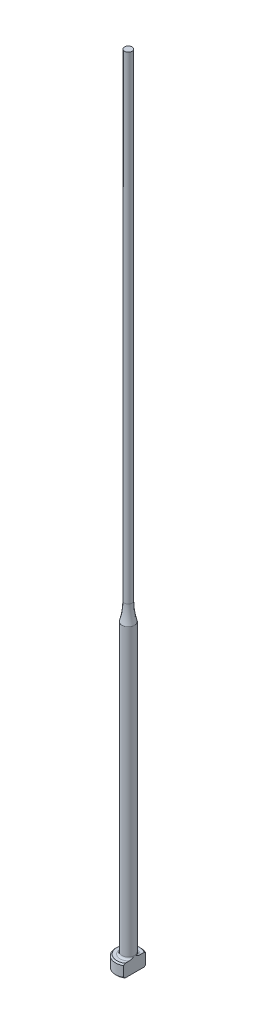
ISO-10303-21;
HEADER;
FILE_DESCRIPTION(('STEP AP214'),'2;1');
FILE_NAME('part.step','',(''),(''),'','','');
FILE_SCHEMA(('AUTOMOTIVE_DESIGN { 1 0 10303 214 1 1 1 1 }'));
ENDSEC;
DATA;
#1=APPLICATION_CONTEXT('core data for automotive mechanical design processes');
#2=APPLICATION_PROTOCOL_DEFINITION('international standard','automotive_design',2000,#1);
#3=PRODUCT_CONTEXT('',#1,'mechanical');
#4=PRODUCT('Part','Part','',(#3));
#5=PRODUCT_RELATED_PRODUCT_CATEGORY('part','',(#4));
#6=PRODUCT_DEFINITION_FORMATION('','',#4);
#7=PRODUCT_DEFINITION_CONTEXT('part definition',#1,'design');
#8=PRODUCT_DEFINITION('design','',#6,#7);
#9=PRODUCT_DEFINITION_SHAPE('','',#8);
#10=(LENGTH_UNIT() NAMED_UNIT(*) SI_UNIT(.MILLI.,.METRE.));
#11=(NAMED_UNIT(*) PLANE_ANGLE_UNIT() SI_UNIT($,.RADIAN.));
#12=(NAMED_UNIT(*) SI_UNIT($,.STERADIAN.) SOLID_ANGLE_UNIT());
#13=UNCERTAINTY_MEASURE_WITH_UNIT(LENGTH_MEASURE(1.E-05),#10,'distance_accuracy_value','');
#14=(GEOMETRIC_REPRESENTATION_CONTEXT(3) GLOBAL_UNCERTAINTY_ASSIGNED_CONTEXT((#13)) GLOBAL_UNIT_ASSIGNED_CONTEXT((#10,
#11,#12)) REPRESENTATION_CONTEXT('',''));
#15=CARTESIAN_POINT('',(0.,0.,0.));
#16=DIRECTION('',(0.,0.,1.));
#17=DIRECTION('',(1.,0.,0.));
#18=AXIS2_PLACEMENT_3D('',#15,#16,#17);
#19=CARTESIAN_POINT('',(-1.99999999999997,2.,0.));
#20=DIRECTION('',(0.,1.,0.));
#21=DIRECTION('',(0.,0.,1.));
#22=AXIS2_PLACEMENT_3D('',#19,#20,#21);
#23=PLANE('',#22);
#24=CARTESIAN_POINT('',(0.,2.,0.));
#25=DIRECTION('',(0.,1.,0.));
#26=DIRECTION('',(0.,0.,1.));
#27=AXIS2_PLACEMENT_3D('',#24,#25,#26);
#28=CIRCLE('',#27,1.79999999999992);
#29=CARTESIAN_POINT('',(0.999999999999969,2.,-1.4966629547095));
#30=VERTEX_POINT('',#29);
#31=CARTESIAN_POINT('',(0.999999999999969,2.,1.4966629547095));
#32=VERTEX_POINT('',#31);
#33=EDGE_CURVE('E187',#30,#32,#28,.T.);
#34=ORIENTED_EDGE('',*,*,#33,.T.);
#35=DIRECTION('',(0.,0.,-1.));
#36=VECTOR('',#35,1.);
#37=CARTESIAN_POINT('',(0.999999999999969,2.,0.));
#38=LINE('',#37,#36);
#39=CARTESIAN_POINT('',(0.999999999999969,2.00000000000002,0.830662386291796));
#40=VERTEX_POINT('',#39);
#41=EDGE_CURVE('E57',#32,#40,#38,.T.);
#42=ORIENTED_EDGE('',*,*,#41,.T.);
#43=CARTESIAN_POINT('',(0.,2.,0.));
#44=DIRECTION('',(0.,1.,0.));
#45=DIRECTION('',(0.,0.,1.));
#46=AXIS2_PLACEMENT_3D('',#43,#44,#45);
#47=CIRCLE('',#46,1.29999999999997);
#48=CARTESIAN_POINT('',(0.999999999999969,2.00000000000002,-0.830662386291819));
#49=VERTEX_POINT('',#48);
#50=EDGE_CURVE('E108',#40,#49,#47,.F.);
#51=ORIENTED_EDGE('',*,*,#50,.T.);
#52=EDGE_CURVE('E137',#49,#30,#38,.T.);
#53=ORIENTED_EDGE('',*,*,#52,.T.);
#54=EDGE_LOOP('',(#34,#42,#51,#53));
#55=FACE_BOUND('',#54,.T.);
#56=ADVANCED_FACE('F32',(#55),#23,.T.);
#57=CARTESIAN_POINT('',(0.,259.958771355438,0.));
#58=DIRECTION('',(0.,1.,0.));
#59=DIRECTION('',(0.,0.,1.));
#60=AXIS2_PLACEMENT_3D('',#57,#58,#59);
#61=CYLINDRICAL_SURFACE('',#60,1.99999999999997);
#62=CARTESIAN_POINT('',(0.,1.79999999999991,0.));
#63=DIRECTION('',(0.,1.,0.));
#64=DIRECTION('',(0.,0.,1.));
#65=AXIS2_PLACEMENT_3D('',#62,#63,#64);
#66=CIRCLE('',#65,1.99999999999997);
#67=CARTESIAN_POINT('',(0.999999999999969,1.79999999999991,1.73205080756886));
#68=VERTEX_POINT('',#67);
#69=CARTESIAN_POINT('',(0.999999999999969,1.79999999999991,-1.73205080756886));
#70=VERTEX_POINT('',#69);
#71=EDGE_CURVE('E105',#68,#70,#66,.F.);
#72=ORIENTED_EDGE('',*,*,#71,.T.);
#73=DIRECTION('',(0.,-1.,0.));
#74=VECTOR('',#73,1.);
#75=CARTESIAN_POINT('',(0.999999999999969,125.,-1.73205080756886));
#76=LINE('',#75,#74);
#77=CARTESIAN_POINT('',(0.999999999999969,0.199999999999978,-1.73205080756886));
#78=VERTEX_POINT('',#77);
#79=EDGE_CURVE('E193',#70,#78,#76,.T.);
#80=ORIENTED_EDGE('',*,*,#79,.T.);
#81=CARTESIAN_POINT('',(0.,0.199999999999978,0.));
#82=DIRECTION('',(0.,-1.,0.));
#83=DIRECTION('',(0.,0.,-1.));
#84=AXIS2_PLACEMENT_3D('',#81,#82,#83);
#85=CIRCLE('',#84,1.99999999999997);
#86=CARTESIAN_POINT('',(0.999999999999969,0.199999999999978,1.73205080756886));
#87=VERTEX_POINT('',#86);
#88=EDGE_CURVE('E100',#78,#87,#85,.F.);
#89=ORIENTED_EDGE('',*,*,#88,.T.);
#90=DIRECTION('',(0.,-1.,0.));
#91=VECTOR('',#90,1.);
#92=CARTESIAN_POINT('',(0.999999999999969,125.,1.73205080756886));
#93=LINE('',#92,#91);
#94=EDGE_CURVE('E93',#68,#87,#93,.T.);
#95=ORIENTED_EDGE('',*,*,#94,.F.);
#96=EDGE_LOOP('',(#72,#80,#89,#95));
#97=FACE_BOUND('',#96,.T.);
#98=ADVANCED_FACE('F158',(#97),#61,.T.);
#99=CARTESIAN_POINT('',(0.,0.,0.));
#100=DIRECTION('',(0.,-1.,0.));
#101=DIRECTION('',(0.,0.,-1.));
#102=AXIS2_PLACEMENT_3D('',#99,#100,#101);
#103=PLANE('',#102);
#104=CARTESIAN_POINT('',(0.,0.,0.));
#105=DIRECTION('',(0.,-1.,0.));
#106=DIRECTION('',(0.,0.,-1.));
#107=AXIS2_PLACEMENT_3D('',#104,#105,#106);
#108=CIRCLE('',#107,1.8);
#109=CARTESIAN_POINT('',(0.999999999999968,0.,1.49666295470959));
#110=VERTEX_POINT('',#109);
#111=CARTESIAN_POINT('',(0.999999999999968,0.,-1.49666295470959));
#112=VERTEX_POINT('',#111);
#113=EDGE_CURVE('E98',#110,#112,#108,.T.);
#114=ORIENTED_EDGE('',*,*,#113,.T.);
#115=DIRECTION('',(0.,0.,1.));
#116=VECTOR('',#115,1.);
#117=CARTESIAN_POINT('',(0.999999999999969,0.,-1.73205080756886));
#118=LINE('',#117,#116);
#119=EDGE_CURVE('E83',#112,#110,#118,.T.);
#120=ORIENTED_EDGE('',*,*,#119,.T.);
#121=EDGE_LOOP('',(#114,#120));
#122=FACE_BOUND('',#121,.T.);
#123=ADVANCED_FACE('F103',(#122),#103,.T.);
#124=CARTESIAN_POINT('',(0.,2.,0.));
#125=DIRECTION('',(0.,-1.,0.));
#126=DIRECTION('',(0.,0.,-1.));
#127=AXIS2_PLACEMENT_3D('',#124,#125,#126);
#128=CONICAL_SURFACE('',#127,1.79999999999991,0.785398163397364);
#129=ORIENTED_EDGE('',*,*,#71,.F.);
#130=CARTESIAN_POINT('',(0.999999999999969,-0.143084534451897,3.81417299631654));
#131=CARTESIAN_POINT('',(0.999999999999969,-0.0593997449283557,3.72765647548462));
#132=CARTESIAN_POINT('',(0.999999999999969,0.0241940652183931,3.64105173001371));
#133=CARTESIAN_POINT('',(0.999999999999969,0.19114891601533,3.46761616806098));
#134=CARTESIAN_POINT('',(0.999999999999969,0.27450995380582,3.38078534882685));
#135=CARTESIAN_POINT('',(0.999999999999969,0.52424932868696,3.11979400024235));
#136=CARTESIAN_POINT('',(0.999999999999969,0.690198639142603,2.94522254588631));
#137=CARTESIAN_POINT('',(0.999999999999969,1.0169755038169,2.59782670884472));
#138=CARTESIAN_POINT('',(0.999999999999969,1.1778392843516,2.42503661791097));
#139=CARTESIAN_POINT('',(0.999999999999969,1.41669118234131,2.16364984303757));
#140=CARTESIAN_POINT('',(0.999999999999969,1.49589273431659,2.07616357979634));
#141=CARTESIAN_POINT('',(0.999999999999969,1.653138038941,1.90015721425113));
#142=CARTESIAN_POINT('',(0.999999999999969,1.73118183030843,1.81163714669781));
#143=CARTESIAN_POINT('',(0.999999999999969,1.85567318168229,1.66767927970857));
#144=CARTESIAN_POINT('',(0.999999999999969,1.90265415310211,1.61270332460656));
#145=CARTESIAN_POINT('',(0.999999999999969,1.99577882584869,1.50203557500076));
#146=CARTESIAN_POINT('',(0.999999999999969,2.04192244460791,1.44634371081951));
#147=CARTESIAN_POINT('',(0.999999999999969,2.13356596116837,1.33345480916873));
#148=CARTESIAN_POINT('',(0.999999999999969,2.17905399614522,1.27624810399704));
#149=CARTESIAN_POINT('',(0.999999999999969,2.26844283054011,1.1606097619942));
#150=CARTESIAN_POINT('',(0.999999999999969,2.31234379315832,1.1021782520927));
#151=CARTESIAN_POINT('',(0.999999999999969,2.39853453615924,0.982773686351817));
#152=CARTESIAN_POINT('',(0.999999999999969,2.44078986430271,0.92177554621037));
#153=CARTESIAN_POINT('',(0.999999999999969,2.5218781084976,0.79738711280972));
#154=CARTESIAN_POINT('',(0.999999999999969,2.56070631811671,0.733993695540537));
#155=CARTESIAN_POINT('',(0.999999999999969,2.63248592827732,0.604932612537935));
#156=CARTESIAN_POINT('',(0.999999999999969,2.66550424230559,0.539302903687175));
#157=CARTESIAN_POINT('',(0.999999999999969,2.72301550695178,0.404437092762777));
#158=CARTESIAN_POINT('',(0.999999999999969,2.74753707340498,0.335214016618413));
#159=CARTESIAN_POINT('',(0.999999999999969,2.77407110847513,0.231400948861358));
#160=CARTESIAN_POINT('',(0.999999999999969,2.78110742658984,0.198093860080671));
#161=CARTESIAN_POINT('',(0.999999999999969,2.79200506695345,0.130954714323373));
#162=CARTESIAN_POINT('',(0.999999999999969,2.79586666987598,0.0971227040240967));
#163=CARTESIAN_POINT('',(0.999999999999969,2.80013905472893,0.0293410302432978));
#164=CARTESIAN_POINT('',(0.999999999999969,2.80056046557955,-0.00460794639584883));
#165=CARTESIAN_POINT('',(0.999999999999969,2.79795882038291,-0.0723663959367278));
#166=CARTESIAN_POINT('',(0.999999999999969,2.79493547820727,-0.106175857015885));
#167=CARTESIAN_POINT('',(0.999999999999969,2.78105481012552,-0.206326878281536));
#168=CARTESIAN_POINT('',(0.999999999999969,2.76542146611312,-0.272037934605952));
#169=CARTESIAN_POINT('',(0.999999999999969,2.73477554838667,-0.368312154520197));
#170=CARTESIAN_POINT('',(0.999999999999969,2.72331063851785,-0.400123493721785));
#171=CARTESIAN_POINT('',(0.999999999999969,2.69840546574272,-0.462964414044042));
#172=CARTESIAN_POINT('',(0.999999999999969,2.68496560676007,-0.493994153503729));
#173=CARTESIAN_POINT('',(0.999999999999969,2.64209309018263,-0.586298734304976));
#174=CARTESIAN_POINT('',(0.999999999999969,2.61022871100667,-0.64643570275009));
#175=CARTESIAN_POINT('',(0.999999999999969,2.54228534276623,-0.76430433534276));
#176=CARTESIAN_POINT('',(0.999999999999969,2.50620119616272,-0.822032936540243));
#177=CARTESIAN_POINT('',(0.999999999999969,2.43107084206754,-0.935840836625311));
#178=CARTESIAN_POINT('',(0.999999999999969,2.39201347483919,-0.991912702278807));
#179=CARTESIAN_POINT('',(0.999999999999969,2.31195870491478,-1.10259849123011));
#180=CARTESIAN_POINT('',(0.999999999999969,2.27096226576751,-1.15721311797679));
#181=CARTESIAN_POINT('',(0.999999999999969,2.18701695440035,-1.26606869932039));
#182=CARTESIAN_POINT('',(0.999999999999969,2.14404946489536,-1.32029522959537));
#183=CARTESIAN_POINT('',(0.999999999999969,2.05705050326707,-1.42788988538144));
#184=CARTESIAN_POINT('',(0.999999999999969,2.01301896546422,-1.48125795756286));
#185=CARTESIAN_POINT('',(0.999999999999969,1.8799506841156,-1.64010952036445));
#186=CARTESIAN_POINT('',(0.999999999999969,1.78973357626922,-1.74460261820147));
#187=CARTESIAN_POINT('',(0.999999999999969,1.62290341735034,-1.9342683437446));
#188=CARTESIAN_POINT('',(0.999999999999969,1.54658658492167,-2.01970404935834));
#189=CARTESIAN_POINT('',(0.999999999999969,1.39301250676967,-2.18973019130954));
#190=CARTESIAN_POINT('',(0.999999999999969,1.31575523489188,-2.27432060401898));
#191=CARTESIAN_POINT('',(0.999999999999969,1.08283440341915,-2.52732479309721));
#192=CARTESIAN_POINT('',(0.999999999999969,0.926165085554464,-2.69481086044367));
#193=CARTESIAN_POINT('',(0.999999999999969,0.617772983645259,-3.0214725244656));
#194=CARTESIAN_POINT('',(0.999999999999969,0.466111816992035,-3.18070657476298));
#195=CARTESIAN_POINT('',(0.999999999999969,0.238015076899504,-3.41880818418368));
#196=CARTESIAN_POINT('',(0.999999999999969,0.161924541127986,-3.49800657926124));
#197=CARTESIAN_POINT('',(0.999999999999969,0.00955322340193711,-3.65621892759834));
#198=CARTESIAN_POINT('',(0.999999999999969,-0.0667275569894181,-3.73523288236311));
#199=CARTESIAN_POINT('',(0.999999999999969,-0.143084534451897,-3.81417299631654));
#200=B_SPLINE_CURVE_WITH_KNOTS('',3,(#130,#131,#132,#133,#134,#135,#136,#137,#138,#139,#140,
#141,#142,#143,#144,#145,#146,#147,#148,#149,#150,#151,#152,#153,#154,#155,#156,#157,#158,#159,
#160,#161,#162,#163,#164,#165,#166,#167,#168,#169,#170,#171,#172,#173,#174,#175,#176,#177,#178,
#179,#180,#181,#182,#183,#184,#185,#186,#187,#188,#189,#190,#191,#192,#193,#194,#195,#196,#197,
#198,#199),.UNSPECIFIED.,.F.,.F.,(4,2,2,2,2,2,2,2,2,2,2,2,2,2,2,2,2,2,2,2,2,2,2,2,2,2,2,2,2,2,2,
2,2,2,4),(0.,0.361101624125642,0.722207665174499,1.44478731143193,2.15299784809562,
2.50702638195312,2.86104304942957,3.07798416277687,3.29494655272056,3.51418925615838,
3.73340935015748,3.95594813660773,4.17878792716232,4.3988639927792,4.6181915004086,
4.72018864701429,4.82217677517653,4.92384967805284,5.02553102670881,5.22698459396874,
5.32838854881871,5.4297717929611,5.63365200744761,5.83778406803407,6.04272417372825,
6.24756349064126,6.4551039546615,6.66265726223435,7.07676259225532,7.42043039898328,
7.76410778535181,8.45210822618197,9.11180822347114,9.44129145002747,9.77077197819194),.UNSPECIFIED.);
#201=EDGE_CURVE('E136',#68,#32,#200,.T.);
#202=ORIENTED_EDGE('',*,*,#201,.T.);
#203=ORIENTED_EDGE('',*,*,#33,.F.);
#204=EDGE_CURVE('E128',#30,#70,#200,.T.);
#205=ORIENTED_EDGE('',*,*,#204,.T.);
#206=EDGE_LOOP('',(#129,#202,#203,#205));
#207=FACE_BOUND('',#206,.T.);
#208=ADVANCED_FACE('F144',(#207),#128,.T.);
#209=CARTESIAN_POINT('',(0.,0.199999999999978,0.));
#210=DIRECTION('',(0.,1.,0.));
#211=DIRECTION('',(0.,0.,1.));
#212=AXIS2_PLACEMENT_3D('',#209,#210,#211);
#213=CONICAL_SURFACE('',#212,1.99999999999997,0.785398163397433);
#214=ORIENTED_EDGE('',*,*,#88,.F.);
#215=CARTESIAN_POINT('',(0.999999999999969,2.14308453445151,-3.81417299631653));
#216=CARTESIAN_POINT('',(0.999999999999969,2.05939974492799,-3.72765647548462));
#217=CARTESIAN_POINT('',(0.999999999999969,1.97580593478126,-3.64105173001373));
#218=CARTESIAN_POINT('',(0.999999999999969,1.80885108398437,-3.46761616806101));
#219=CARTESIAN_POINT('',(0.999999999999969,1.7254900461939,-3.38078534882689));
#220=CARTESIAN_POINT('',(0.999999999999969,1.47575067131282,-3.11979400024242));
#221=CARTESIAN_POINT('',(0.999999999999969,1.30980136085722,-2.94522254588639));
#222=CARTESIAN_POINT('',(0.999999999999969,0.983024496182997,-2.59782670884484));
#223=CARTESIAN_POINT('',(0.999999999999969,0.822160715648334,-2.42503661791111));
#224=CARTESIAN_POINT('',(0.999999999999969,0.583308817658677,-2.16364984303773));
#225=CARTESIAN_POINT('',(0.999999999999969,0.504107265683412,-2.07616357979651));
#226=CARTESIAN_POINT('',(0.999999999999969,0.34686196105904,-1.90015721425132));
#227=CARTESIAN_POINT('',(0.999999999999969,0.268818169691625,-1.81163714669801));
#228=CARTESIAN_POINT('',(0.999999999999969,0.144326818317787,-1.66767927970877));
#229=CARTESIAN_POINT('',(0.999999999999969,0.097345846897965,-1.61270332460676));
#230=CARTESIAN_POINT('',(0.999999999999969,0.00422117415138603,-1.50203557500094));
#231=CARTESIAN_POINT('',(0.999999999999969,-0.0419224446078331,-1.44634371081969));
#232=CARTESIAN_POINT('',(0.999999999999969,-0.133565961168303,-1.33345480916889));
#233=CARTESIAN_POINT('',(0.999999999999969,-0.179053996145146,-1.2762481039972));
#234=CARTESIAN_POINT('',(0.999999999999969,-0.268442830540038,-1.16060976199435));
#235=CARTESIAN_POINT('',(0.999999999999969,-0.312343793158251,-1.10217825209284));
#236=CARTESIAN_POINT('',(0.999999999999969,-0.398534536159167,-0.982773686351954));
#237=CARTESIAN_POINT('',(0.999999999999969,-0.440789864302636,-0.921775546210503));
#238=CARTESIAN_POINT('',(0.999999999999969,-0.521878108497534,-0.797387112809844));
#239=CARTESIAN_POINT('',(0.999999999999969,-0.560706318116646,-0.733993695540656));
#240=CARTESIAN_POINT('',(0.999999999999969,-0.632485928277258,-0.604932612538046));
#241=CARTESIAN_POINT('',(0.999999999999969,-0.665504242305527,-0.539302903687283));
#242=CARTESIAN_POINT('',(0.999999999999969,-0.723015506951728,-0.404437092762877));
#243=CARTESIAN_POINT('',(0.999999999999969,-0.747537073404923,-0.335214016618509));
#244=CARTESIAN_POINT('',(0.999999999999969,-0.774071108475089,-0.231400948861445));
#245=CARTESIAN_POINT('',(0.999999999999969,-0.781107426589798,-0.198093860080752));
#246=CARTESIAN_POINT('',(0.999999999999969,-0.792005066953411,-0.130954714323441));
#247=CARTESIAN_POINT('',(0.999999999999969,-0.795866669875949,-0.097122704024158));
#248=CARTESIAN_POINT('',(0.999999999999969,-0.800139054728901,-0.0293410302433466));
#249=CARTESIAN_POINT('',(0.999999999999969,-0.800560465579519,0.00460794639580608));
#250=CARTESIAN_POINT('',(0.999999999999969,-0.797958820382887,0.0723663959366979));
#251=CARTESIAN_POINT('',(0.999999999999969,-0.794935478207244,0.106175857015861));
#252=CARTESIAN_POINT('',(0.999999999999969,-0.78105481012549,0.206326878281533));
#253=CARTESIAN_POINT('',(0.999999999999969,-0.765421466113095,0.272037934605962));
#254=CARTESIAN_POINT('',(0.999999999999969,-0.734775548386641,0.368312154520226));
#255=CARTESIAN_POINT('',(0.999999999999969,-0.723310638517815,0.40012349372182));
#256=CARTESIAN_POINT('',(0.999999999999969,-0.698405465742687,0.46296441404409));
#257=CARTESIAN_POINT('',(0.999999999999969,-0.684965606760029,0.493994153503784));
#258=CARTESIAN_POINT('',(0.999999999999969,-0.642093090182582,0.586298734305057));
#259=CARTESIAN_POINT('',(0.999999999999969,-0.610228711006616,0.64643570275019));
#260=CARTESIAN_POINT('',(0.999999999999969,-0.542285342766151,0.764304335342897));
#261=CARTESIAN_POINT('',(0.999999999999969,-0.506201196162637,0.822032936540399));
#262=CARTESIAN_POINT('',(0.999999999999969,-0.431070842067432,0.935840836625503));
#263=CARTESIAN_POINT('',(0.999999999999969,-0.392013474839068,0.991912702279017));
#264=CARTESIAN_POINT('',(0.999999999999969,-0.311958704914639,1.10259849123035));
#265=CARTESIAN_POINT('',(0.999999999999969,-0.27096226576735,1.15721311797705));
#266=CARTESIAN_POINT('',(0.999999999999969,-0.187016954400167,1.26606869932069));
#267=CARTESIAN_POINT('',(0.999999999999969,-0.144049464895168,1.32029522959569));
#268=CARTESIAN_POINT('',(0.999999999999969,-0.0570505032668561,1.4278898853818));
#269=CARTESIAN_POINT('',(0.999999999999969,-0.0130189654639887,1.48125795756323));
#270=CARTESIAN_POINT('',(0.999999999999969,0.120049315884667,1.64010952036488));
#271=CARTESIAN_POINT('',(0.999999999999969,0.21026642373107,1.74460261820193));
#272=CARTESIAN_POINT('',(0.999999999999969,0.377096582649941,1.93426834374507));
#273=CARTESIAN_POINT('',(0.999999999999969,0.453413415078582,2.01970404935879));
#274=CARTESIAN_POINT('',(0.999999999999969,0.606987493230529,2.18973019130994));
#275=CARTESIAN_POINT('',(0.999999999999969,0.684244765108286,2.27432060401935));
#276=CARTESIAN_POINT('',(0.999999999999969,0.917165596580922,2.52732479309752));
#277=CARTESIAN_POINT('',(0.999999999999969,1.07383491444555,2.69481086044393));
#278=CARTESIAN_POINT('',(0.999999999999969,1.38222701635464,3.02147252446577));
#279=CARTESIAN_POINT('',(0.999999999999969,1.53388818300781,3.18070657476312));
#280=CARTESIAN_POINT('',(0.999999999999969,1.76198492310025,3.41880818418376));
#281=CARTESIAN_POINT('',(0.999999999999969,1.83807545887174,3.49800657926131));
#282=CARTESIAN_POINT('',(0.999999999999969,1.99044677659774,3.65621892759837));
#283=CARTESIAN_POINT('',(0.999999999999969,2.06672755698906,3.73523288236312));
#284=CARTESIAN_POINT('',(0.999999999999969,2.14308453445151,3.81417299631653));
#285=B_SPLINE_CURVE_WITH_KNOTS('',3,(#215,#216,#217,#218,#219,#220,#221,#222,#223,#224,#225,
#226,#227,#228,#229,#230,#231,#232,#233,#234,#235,#236,#237,#238,#239,#240,#241,#242,#243,#244,
#245,#246,#247,#248,#249,#250,#251,#252,#253,#254,#255,#256,#257,#258,#259,#260,#261,#262,#263,
#264,#265,#266,#267,#268,#269,#270,#271,#272,#273,#274,#275,#276,#277,#278,#279,#280,#281,#282,
#283,#284),.UNSPECIFIED.,.F.,.F.,(4,2,2,2,2,2,2,2,2,2,2,2,2,2,2,2,2,2,2,2,2,2,2,2,2,2,2,2,2,2,2,
2,2,2,4),(0.,0.36110162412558,0.722207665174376,1.44478731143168,2.15299784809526,
2.5070263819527,2.8610430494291,3.07798416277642,3.29494655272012,3.51418925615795,
3.73340935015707,3.95594813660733,4.17878792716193,4.39886399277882,4.61819150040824,
4.72018864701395,4.82217677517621,4.92384967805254,5.02553102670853,5.22698459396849,
5.32838854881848,5.42977179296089,5.63365200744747,5.83778406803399,6.04272417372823,
6.24756349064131,6.45510395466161,6.66265726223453,7.07676259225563,7.42043039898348,
7.7641077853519,8.45210822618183,9.1118082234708,9.44129145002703,9.77077197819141),.UNSPECIFIED.);
#286=EDGE_CURVE('E86',#78,#112,#285,.T.);
#287=ORIENTED_EDGE('',*,*,#286,.T.);
#288=ORIENTED_EDGE('',*,*,#113,.F.);
#289=EDGE_CURVE('E89',#110,#87,#285,.T.);
#290=ORIENTED_EDGE('',*,*,#289,.T.);
#291=EDGE_LOOP('',(#214,#287,#288,#290));
#292=FACE_BOUND('',#291,.T.);
#293=ADVANCED_FACE('F97',(#292),#213,.T.);
#294=CARTESIAN_POINT('',(0.,2.30000000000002,0.));
#295=DIRECTION('',(0.,1.,0.));
#296=DIRECTION('',(0.,0.,1.));
#297=AXIS2_PLACEMENT_3D('',#294,#295,#296);
#298=TOROIDAL_SURFACE('',#297,1.29999999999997,0.3);
#299=CARTESIAN_POINT('',(0.999999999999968,2.30000000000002,0.));
#300=CARTESIAN_POINT('',(0.999999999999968,2.30000064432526,8.6574445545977E-12));
#301=CARTESIAN_POINT('',(0.999999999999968,2.30000128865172,-9.05742231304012E-08));
#302=CARTESIAN_POINT('',(0.999999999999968,2.30000254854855,-3.98319620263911E-07));
#303=CARTESIAN_POINT('',(0.999999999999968,2.30000316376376,-6.16748313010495E-07));
#304=CARTESIAN_POINT('',(0.999999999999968,2.30000438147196,-1.15047367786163E-06));
#305=CARTESIAN_POINT('',(0.999999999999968,2.30000498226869,-1.46954564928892E-06));
#306=CARTESIAN_POINT('',(0.999999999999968,2.30000613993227,-2.17388585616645E-06));
#307=CARTESIAN_POINT('',(0.999999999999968,2.3000066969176,-2.55896592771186E-06));
#308=CARTESIAN_POINT('',(0.999999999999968,2.30000847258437,-3.89137454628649E-06));
#309=CARTESIAN_POINT('',(0.999999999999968,2.30000962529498,-4.9272569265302E-06));
#310=CARTESIAN_POINT('',(0.999999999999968,2.30001175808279,-7.12255376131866E-06));
#311=CARTESIAN_POINT('',(0.999999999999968,2.30001274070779,-8.27963246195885E-06));
#312=CARTESIAN_POINT('',(0.999999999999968,2.30001619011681,-1.25710396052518E-05));
#313=CARTESIAN_POINT('',(0.999999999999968,2.30001847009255,-1.58589994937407E-05));
#314=CARTESIAN_POINT('',(0.999999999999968,2.3000224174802,-2.25210462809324E-05));
#315=CARTESIAN_POINT('',(0.999999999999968,2.30002411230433,-2.58796667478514E-05));
#316=CARTESIAN_POINT('',(0.999999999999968,2.30003085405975,-3.94941957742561E-05));
#317=CARTESIAN_POINT('',(0.999999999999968,2.30003568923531,-4.98493079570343E-05));
#318=CARTESIAN_POINT('',(0.999999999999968,2.30004388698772,-6.96407730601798E-05));
#319=CARTESIAN_POINT('',(0.999999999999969,2.30004735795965,-7.903098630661E-05));
#320=CARTESIAN_POINT('',(0.999999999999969,2.30007348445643,-0.000144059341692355));
#321=CARTESIAN_POINT('',(0.999999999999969,2.30010510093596,-0.000195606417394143));
#322=CARTESIAN_POINT('',(0.999999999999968,2.30022061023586,-0.000391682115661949));
#323=CARTESIAN_POINT('',(0.999999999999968,2.3002978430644,-0.000539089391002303));
#324=CARTESIAN_POINT('',(0.999999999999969,2.30059433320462,-0.00109591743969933));
#325=CARTESIAN_POINT('',(0.999999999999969,2.30082052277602,-0.00150237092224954));
#326=CARTESIAN_POINT('',(0.999999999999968,2.30171558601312,-0.00311941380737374));
#327=CARTESIAN_POINT('',(0.999999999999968,2.30237677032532,-0.00433326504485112));
#328=CARTESIAN_POINT('',(0.999999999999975,2.31602135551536,-0.0293725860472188));
#329=CARTESIAN_POINT('',(0.99999999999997,2.32909104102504,-0.0531623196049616));
#330=CARTESIAN_POINT('',(0.999999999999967,2.35458080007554,-0.100088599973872));
#331=CARTESIAN_POINT('',(0.999999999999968,2.36700820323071,-0.123221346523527));
#332=CARTESIAN_POINT('',(0.999999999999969,2.39281545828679,-0.172044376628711));
#333=CARTESIAN_POINT('',(0.999999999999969,2.4061616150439,-0.197752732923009));
#334=CARTESIAN_POINT('',(0.999999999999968,2.4323541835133,-0.249714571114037));
#335=CARTESIAN_POINT('',(0.999999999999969,2.44519503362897,-0.27597087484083));
#336=CARTESIAN_POINT('',(0.999999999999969,2.46718175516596,-0.322864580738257));
#337=CARTESIAN_POINT('',(0.999999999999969,2.47650292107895,-0.34341923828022));
#338=CARTESIAN_POINT('',(0.999999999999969,2.49448113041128,-0.384761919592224));
#339=CARTESIAN_POINT('',(0.999999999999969,2.50313958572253,-0.405549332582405));
#340=CARTESIAN_POINT('',(0.999999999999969,2.5276434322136,-0.467585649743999));
#341=CARTESIAN_POINT('',(0.999999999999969,2.54239224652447,-0.509286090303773));
#342=CARTESIAN_POINT('',(0.999999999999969,2.56458900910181,-0.58349816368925));
#343=CARTESIAN_POINT('',(0.999999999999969,2.57294045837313,-0.61573699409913));
#344=CARTESIAN_POINT('',(0.999999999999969,2.58691787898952,-0.682155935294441));
#345=CARTESIAN_POINT('',(0.999999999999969,2.5924232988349,-0.716362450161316));
#346=CARTESIAN_POINT('',(0.999999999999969,2.59932200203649,-0.784996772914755));
#347=CARTESIAN_POINT('',(0.999999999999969,2.60074119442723,-0.819421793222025));
#348=CARTESIAN_POINT('',(0.999999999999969,2.59853032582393,-0.88779225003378));
#349=CARTESIAN_POINT('',(0.999999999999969,2.59495737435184,-0.921738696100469));
#350=CARTESIAN_POINT('',(0.999999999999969,2.58381038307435,-0.977927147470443));
#351=CARTESIAN_POINT('',(0.999999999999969,2.57785171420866,-1.00048693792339));
#352=CARTESIAN_POINT('',(0.999999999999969,2.56267132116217,-1.0445512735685));
#353=CARTESIAN_POINT('',(0.999999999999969,2.55344592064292,-1.06605459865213));
#354=CARTESIAN_POINT('',(0.999999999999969,2.53348156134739,-1.10327564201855));
#355=CARTESIAN_POINT('',(0.999999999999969,2.52335553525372,-1.11931996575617));
#356=CARTESIAN_POINT('',(0.999999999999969,2.50063930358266,-1.1495565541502));
#357=CARTESIAN_POINT('',(0.999999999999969,2.48805327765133,-1.16375189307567));
#358=CARTESIAN_POINT('',(0.999999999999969,2.46313284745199,-1.18709127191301));
#359=CARTESIAN_POINT('',(0.999999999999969,2.45121755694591,-1.19668155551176));
#360=CARTESIAN_POINT('',(0.999999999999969,2.4259612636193,-1.21377371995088));
#361=CARTESIAN_POINT('',(0.999999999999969,2.41262072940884,-1.2212762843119));
#362=CARTESIAN_POINT('',(0.999999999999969,2.38471163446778,-1.23381879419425));
#363=CARTESIAN_POINT('',(0.999999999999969,2.3701356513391,-1.23884240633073));
#364=CARTESIAN_POINT('',(0.999999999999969,2.34029120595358,-1.2460136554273));
#365=CARTESIAN_POINT('',(0.999999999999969,2.32502317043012,-1.24816304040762));
#366=CARTESIAN_POINT('',(0.999999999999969,2.29609418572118,-1.24936303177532));
#367=CARTESIAN_POINT('',(0.999999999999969,2.28244572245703,-1.24873511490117));
#368=CARTESIAN_POINT('',(0.999999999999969,2.25546467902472,-1.24513625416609));
#369=CARTESIAN_POINT('',(0.999999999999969,2.2421320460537,-1.24216570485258));
#370=CARTESIAN_POINT('',(0.999999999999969,2.21644742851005,-1.23414136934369));
#371=CARTESIAN_POINT('',(0.999999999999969,2.20408009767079,-1.22913614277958));
#372=CARTESIAN_POINT('',(0.999999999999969,2.18026539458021,-1.2172891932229));
#373=CARTESIAN_POINT('',(0.999999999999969,2.16881815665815,-1.21044720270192));
#374=CARTESIAN_POINT('',(0.999999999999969,2.14602713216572,-1.19450929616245));
#375=CARTESIAN_POINT('',(0.999999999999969,2.1347876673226,-1.18526487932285));
#376=CARTESIAN_POINT('',(0.999999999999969,2.11372805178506,-1.16528066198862));
#377=CARTESIAN_POINT('',(0.999999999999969,2.1039092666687,-1.15453944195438));
#378=CARTESIAN_POINT('',(0.999999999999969,2.08131380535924,-1.12639326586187));
#379=CARTESIAN_POINT('',(0.999999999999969,2.06941227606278,-1.10828305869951));
#380=CARTESIAN_POINT('',(0.999999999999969,2.04871157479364,-1.07041295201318));
#381=CARTESIAN_POINT('',(0.999999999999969,2.03991325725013,-1.05065259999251));
#382=CARTESIAN_POINT('',(0.999999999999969,2.02219264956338,-1.00203188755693));
#383=CARTESIAN_POINT('',(0.999999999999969,2.01461756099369,-0.972682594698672));
#384=CARTESIAN_POINT('',(0.999999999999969,2.00410660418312,-0.912914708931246));
#385=CARTESIAN_POINT('',(0.999999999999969,2.00122174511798,-0.882487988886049));
#386=CARTESIAN_POINT('',(0.999999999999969,1.99886242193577,-0.80318909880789));
#387=CARTESIAN_POINT('',(0.999999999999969,2.0024814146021,-0.754226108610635));
#388=CARTESIAN_POINT('',(0.999999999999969,2.01327071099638,-0.682724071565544));
#389=CARTESIAN_POINT('',(0.999999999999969,2.01762186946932,-0.659663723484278));
#390=CARTESIAN_POINT('',(0.999999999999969,2.02775671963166,-0.613959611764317));
#391=CARTESIAN_POINT('',(0.999999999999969,2.03353398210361,-0.59131445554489));
#392=CARTESIAN_POINT('',(0.999999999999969,2.05232003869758,-0.525222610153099));
#393=CARTESIAN_POINT('',(0.999999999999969,2.0670175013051,-0.482256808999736));
#394=CARTESIAN_POINT('',(0.999999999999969,2.09166172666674,-0.418361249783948));
#395=CARTESIAN_POINT('',(0.999999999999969,2.10040936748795,-0.396945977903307));
#396=CARTESIAN_POINT('',(0.999999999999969,2.11862724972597,-0.354367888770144));
#397=CARTESIAN_POINT('',(0.999999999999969,2.12809902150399,-0.33320572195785));
#398=CARTESIAN_POINT('',(0.999999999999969,2.15054796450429,-0.284809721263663));
#399=CARTESIAN_POINT('',(0.999999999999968,2.16372144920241,-0.257667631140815));
#400=CARTESIAN_POINT('',(0.999999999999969,2.19063957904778,-0.203972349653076));
#401=CARTESIAN_POINT('',(0.999999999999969,2.20437810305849,-0.177416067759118));
#402=CARTESIAN_POINT('',(0.999999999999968,2.23096755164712,-0.127000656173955));
#403=CARTESIAN_POINT('',(0.999999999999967,2.2437812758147,-0.103121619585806));
#404=CARTESIAN_POINT('',(0.99999999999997,2.27007504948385,-0.0546869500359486));
#405=CARTESIAN_POINT('',(0.999999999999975,2.28356304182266,-0.0301354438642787));
#406=CARTESIAN_POINT('',(0.999999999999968,2.29762327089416,-0.00433318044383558));
#407=CARTESIAN_POINT('',(0.999999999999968,2.29828450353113,-0.00311924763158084));
#408=CARTESIAN_POINT('',(0.999999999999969,2.29917957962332,-0.0015021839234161));
#409=CARTESIAN_POINT('',(0.999999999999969,2.2994057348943,-0.0010957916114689));
#410=CARTESIAN_POINT('',(0.999999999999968,2.29970218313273,-0.000539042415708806));
#411=CARTESIAN_POINT('',(0.999999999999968,2.29977940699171,-0.000391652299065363));
#412=CARTESIAN_POINT('',(0.999999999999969,2.29989490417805,-0.000195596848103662));
#413=CARTESIAN_POINT('',(0.999999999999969,2.2999265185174,-0.000144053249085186));
#414=CARTESIAN_POINT('',(0.999999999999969,2.29995264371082,-7.90290824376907E-05));
#415=CARTESIAN_POINT('',(0.999999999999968,2.29995611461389,-6.96391975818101E-05));
#416=CARTESIAN_POINT('',(0.999999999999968,2.29996431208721,-4.98484228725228E-05));
#417=CARTESIAN_POINT('',(0.999999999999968,2.29996914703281,-3.94936645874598E-05));
#418=CARTESIAN_POINT('',(0.999999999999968,2.29997588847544,-2.587953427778E-05));
#419=CARTESIAN_POINT('',(0.999999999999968,2.29997758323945,-2.25209724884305E-05));
#420=CARTESIAN_POINT('',(0.999999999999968,2.29998153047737,-1.58590310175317E-05));
#421=CARTESIAN_POINT('',(0.999999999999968,2.29998381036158,-1.25711163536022E-05));
#422=CARTESIAN_POINT('',(0.999999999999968,2.29998725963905,-8.27974911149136E-06));
#423=CARTESIAN_POINT('',(0.999999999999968,2.29998824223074,-7.122675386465E-06));
#424=CARTESIAN_POINT('',(0.999999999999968,2.29999037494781,-4.92738159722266E-06));
#425=CARTESIAN_POINT('',(0.999999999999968,2.29999152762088,-3.89149712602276E-06));
#426=CARTESIAN_POINT('',(0.999999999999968,2.29999330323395,-2.5590774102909E-06));
#427=CARTESIAN_POINT('',(0.999999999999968,2.29999386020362,-2.17399250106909E-06));
#428=CARTESIAN_POINT('',(0.999999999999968,2.29999501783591,-1.4696398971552E-06));
#429=CARTESIAN_POINT('',(0.999999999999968,2.299995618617,-1.15056035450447E-06));
#430=CARTESIAN_POINT('',(0.999999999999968,2.29999683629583,-6.16816558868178E-07));
#431=CARTESIAN_POINT('',(0.999999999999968,2.29999745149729,-3.98377208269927E-07));
#432=CARTESIAN_POINT('',(0.999999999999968,2.29999871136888,-9.06063088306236E-08));
#433=CARTESIAN_POINT('',(0.999999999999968,2.29999935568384,-8.657323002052E-12));
#434=CARTESIAN_POINT('',(0.999999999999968,2.30000000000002,0.));
#435=B_SPLINE_CURVE_WITH_KNOTS('',3,(#299,#300,#301,#302,#303,#304,#305,#306,#307,#308,#309,
#310,#311,#312,#313,#314,#315,#316,#317,#318,#319,#320,#321,#322,#323,#324,#325,#326,#327,#328,
#329,#330,#331,#332,#333,#334,#335,#336,#337,#338,#339,#340,#341,#342,#343,#344,#345,#346,#347,
#348,#349,#350,#351,#352,#353,#354,#355,#356,#357,#358,#359,#360,#361,#362,#363,#364,#365,#366,
#367,#368,#369,#370,#371,#372,#373,#374,#375,#376,#377,#378,#379,#380,#381,#382,#383,#384,#385,
#386,#387,#388,#389,#390,#391,#392,#393,#394,#395,#396,#397,#398,#399,#400,#401,#402,#403,#404,
#405,#406,#407,#408,#409,#410,#411,#412,#413,#414,#415,#416,#417,#418,#419,#420,#421,#422,#423,
#424,#425,#426,#427,#428,#429,#430,#431,#432,#433,#434),.UNSPECIFIED.,.T.,.F.,(4,2,2,2,2,2,2,2,
2,2,2,2,2,2,2,2,2,2,2,2,2,2,2,2,2,2,2,2,2,2,2,2,2,2,2,2,2,2,2,2,2,2,2,2,2,2,2,2,2,2,2,2,2,2,2,2,
2,2,2,2,2,2,2,2,2,2,2,4),(0.,1.93088000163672E-06,3.88121487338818E-06,5.91576027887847E-06,
7.94459959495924E-06,1.25713540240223E-05,1.71213138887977E-05,2.9075120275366E-05,
4.0350817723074E-05,7.46190414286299E-05,0.000104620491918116,0.00028499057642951,
0.000785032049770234,0.00217951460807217,0.00632720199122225,0.0877445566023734,
0.166524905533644,0.253417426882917,0.341089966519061,0.408787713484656,0.476336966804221,
0.608850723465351,0.708652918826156,0.812393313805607,0.915474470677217,1.01738599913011,
1.08718721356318,1.15706723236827,1.21377727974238,1.27039179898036,1.31609373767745,
1.36178069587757,1.40776478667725,1.4537208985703,1.49450576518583,1.5352837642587,
1.57514089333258,1.61500383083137,1.65849635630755,1.70203041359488,1.76667915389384,
1.83134568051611,1.92177629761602,2.0131839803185,2.15955153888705,2.22993031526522,
2.29999742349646,2.43600819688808,2.50540041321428,2.57494356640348,2.66544006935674,
2.75513178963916,2.83643278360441,2.92045687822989,2.92460484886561,2.92599912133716,
2.926499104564,2.92667946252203,2.92670946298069,2.92674372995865,2.92675500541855,
2.92676695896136,2.92677150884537,2.92677613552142,2.92677816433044,2.92678019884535,
2.92678214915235,2.92678408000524),.UNSPECIFIED.);
#436=CARTESIAN_POINT('',(0.999999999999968,2.30000000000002,0.));
#437=VERTEX_POINT('',#436);
#438=EDGE_CURVE('E11',#49,#437,#435,.T.);
#439=ORIENTED_EDGE('',*,*,#438,.F.);
#440=ORIENTED_EDGE('',*,*,#50,.F.);
#441=CARTESIAN_POINT('',(0.999999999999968,2.30000000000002,0.));
#442=CARTESIAN_POINT('',(0.999999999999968,2.29999935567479,-8.65741696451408E-12));
#443=CARTESIAN_POINT('',(0.999999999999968,2.29999871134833,9.05742231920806E-08));
#444=CARTESIAN_POINT('',(0.999999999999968,2.2999974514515,3.98319620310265E-07));
#445=CARTESIAN_POINT('',(0.999999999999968,2.29999683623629,6.16748313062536E-07));
#446=CARTESIAN_POINT('',(0.999999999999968,2.29999561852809,1.15047367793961E-06));
#447=CARTESIAN_POINT('',(0.999999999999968,2.29999501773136,1.46954564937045E-06));
#448=CARTESIAN_POINT('',(0.999999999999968,2.29999386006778,2.17388585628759E-06));
#449=CARTESIAN_POINT('',(0.999999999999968,2.29999330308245,2.55896592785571E-06));
#450=CARTESIAN_POINT('',(0.999999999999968,2.29999152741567,3.89137454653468E-06));
#451=CARTESIAN_POINT('',(0.999999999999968,2.29999037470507,4.92725692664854E-06));
#452=CARTESIAN_POINT('',(0.999999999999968,2.29998824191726,7.12255376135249E-06));
#453=CARTESIAN_POINT('',(0.999999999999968,2.29998725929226,8.27963246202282E-06));
#454=CARTESIAN_POINT('',(0.999999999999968,2.29998380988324,1.25710396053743E-05));
#455=CARTESIAN_POINT('',(0.999999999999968,2.2999815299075,1.58589994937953E-05));
#456=CARTESIAN_POINT('',(0.999999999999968,2.29997758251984,2.25210462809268E-05));
#457=CARTESIAN_POINT('',(0.999999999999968,2.29997588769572,2.58796667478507E-05));
#458=CARTESIAN_POINT('',(0.999999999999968,2.29996914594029,3.94941957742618E-05));
#459=CARTESIAN_POINT('',(0.999999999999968,2.29996431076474,4.98493079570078E-05));
#460=CARTESIAN_POINT('',(0.999999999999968,2.29995611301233,6.96407730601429E-05));
#461=CARTESIAN_POINT('',(0.999999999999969,2.2999526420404,7.90309863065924E-05));
#462=CARTESIAN_POINT('',(0.999999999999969,2.29992651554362,0.000144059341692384));
#463=CARTESIAN_POINT('',(0.999999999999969,2.29989489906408,0.000195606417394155));
#464=CARTESIAN_POINT('',(0.999999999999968,2.29977938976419,0.000391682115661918));
#465=CARTESIAN_POINT('',(0.999999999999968,2.29970215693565,0.000539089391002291));
#466=CARTESIAN_POINT('',(0.999999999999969,2.29940566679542,0.00109591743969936));
#467=CARTESIAN_POINT('',(0.999999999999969,2.29917947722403,0.00150237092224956));
#468=CARTESIAN_POINT('',(0.999999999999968,2.29828441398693,0.0031194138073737));
#469=CARTESIAN_POINT('',(0.999999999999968,2.29762322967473,0.0043332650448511));
#470=CARTESIAN_POINT('',(0.999999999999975,2.28397864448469,0.0293725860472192));
#471=CARTESIAN_POINT('',(0.99999999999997,2.27090895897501,0.0531623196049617));
#472=CARTESIAN_POINT('',(0.999999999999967,2.24541919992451,0.100088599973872));
#473=CARTESIAN_POINT('',(0.999999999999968,2.23299179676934,0.123221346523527));
#474=CARTESIAN_POINT('',(0.999999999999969,2.20718454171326,0.172044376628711));
#475=CARTESIAN_POINT('',(0.999999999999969,2.19383838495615,0.197752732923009));
#476=CARTESIAN_POINT('',(0.999999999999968,2.16764581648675,0.249714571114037));
#477=CARTESIAN_POINT('',(0.999999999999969,2.15480496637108,0.27597087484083));
#478=CARTESIAN_POINT('',(0.999999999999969,2.13281824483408,0.322864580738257));
#479=CARTESIAN_POINT('',(0.999999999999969,2.1234970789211,0.34341923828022));
#480=CARTESIAN_POINT('',(0.999999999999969,2.10551886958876,0.384761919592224));
#481=CARTESIAN_POINT('',(0.999999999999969,2.09686041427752,0.405549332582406));
#482=CARTESIAN_POINT('',(0.999999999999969,2.07235656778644,0.467585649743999));
#483=CARTESIAN_POINT('',(0.999999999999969,2.05760775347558,0.509286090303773));
#484=CARTESIAN_POINT('',(0.999999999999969,2.03541099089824,0.58349816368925));
#485=CARTESIAN_POINT('',(0.999999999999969,2.02705954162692,0.61573699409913));
#486=CARTESIAN_POINT('',(0.999999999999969,2.01308212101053,0.682155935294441));
#487=CARTESIAN_POINT('',(0.999999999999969,2.00757670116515,0.716362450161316));
#488=CARTESIAN_POINT('',(0.999999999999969,2.00067799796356,0.784996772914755));
#489=CARTESIAN_POINT('',(0.999999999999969,1.99925880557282,0.819421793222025));
#490=CARTESIAN_POINT('',(0.999999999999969,2.00146967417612,0.88779225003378));
#491=CARTESIAN_POINT('',(0.999999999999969,2.00504262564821,0.921738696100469));
#492=CARTESIAN_POINT('',(0.999999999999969,2.0161896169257,0.977927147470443));
#493=CARTESIAN_POINT('',(0.999999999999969,2.02214828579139,1.00048693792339));
#494=CARTESIAN_POINT('',(0.999999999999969,2.03732867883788,1.0445512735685));
#495=CARTESIAN_POINT('',(0.999999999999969,2.04655407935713,1.06605459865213));
#496=CARTESIAN_POINT('',(0.999999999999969,2.06651843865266,1.10327564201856));
#497=CARTESIAN_POINT('',(0.999999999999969,2.07664446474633,1.11931996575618));
#498=CARTESIAN_POINT('',(0.999999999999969,2.09936069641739,1.14955655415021));
#499=CARTESIAN_POINT('',(0.999999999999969,2.11194672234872,1.16375189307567));
#500=CARTESIAN_POINT('',(0.999999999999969,2.13686715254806,1.18709127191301));
#501=CARTESIAN_POINT('',(0.999999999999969,2.14878244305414,1.19668155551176));
#502=CARTESIAN_POINT('',(0.999999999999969,2.17403873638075,1.21377371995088));
#503=CARTESIAN_POINT('',(0.999999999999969,2.18737927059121,1.2212762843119));
#504=CARTESIAN_POINT('',(0.999999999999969,2.21528836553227,1.23381879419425));
#505=CARTESIAN_POINT('',(0.999999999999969,2.22986434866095,1.23884240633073));
#506=CARTESIAN_POINT('',(0.999999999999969,2.25970879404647,1.2460136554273));
#507=CARTESIAN_POINT('',(0.999999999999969,2.27497682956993,1.24816304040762));
#508=CARTESIAN_POINT('',(0.999999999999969,2.30390581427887,1.24936303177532));
#509=CARTESIAN_POINT('',(0.999999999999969,2.31755427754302,1.24873511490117));
#510=CARTESIAN_POINT('',(0.999999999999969,2.34453532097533,1.24513625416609));
#511=CARTESIAN_POINT('',(0.999999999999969,2.35786795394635,1.24216570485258));
#512=CARTESIAN_POINT('',(0.999999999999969,2.38355257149,1.23414136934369));
#513=CARTESIAN_POINT('',(0.999999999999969,2.39591990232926,1.22913614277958));
#514=CARTESIAN_POINT('',(0.999999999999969,2.41973460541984,1.2172891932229));
#515=CARTESIAN_POINT('',(0.999999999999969,2.4311818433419,1.21044720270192));
#516=CARTESIAN_POINT('',(0.999999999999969,2.45397286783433,1.19450929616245));
#517=CARTESIAN_POINT('',(0.999999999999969,2.46521233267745,1.18526487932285));
#518=CARTESIAN_POINT('',(0.999999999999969,2.48627194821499,1.16528066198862));
#519=CARTESIAN_POINT('',(0.999999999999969,2.49609073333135,1.15453944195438));
#520=CARTESIAN_POINT('',(0.999999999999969,2.51868619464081,1.12639326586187));
#521=CARTESIAN_POINT('',(0.999999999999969,2.53058772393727,1.10828305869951));
#522=CARTESIAN_POINT('',(0.999999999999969,2.55128842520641,1.07041295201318));
#523=CARTESIAN_POINT('',(0.999999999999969,2.56008674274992,1.05065259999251));
#524=CARTESIAN_POINT('',(0.999999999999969,2.57780735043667,1.00203188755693));
#525=CARTESIAN_POINT('',(0.999999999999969,2.58538243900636,0.972682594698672));
#526=CARTESIAN_POINT('',(0.999999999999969,2.59589339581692,0.912914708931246));
#527=CARTESIAN_POINT('',(0.999999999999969,2.59877825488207,0.882487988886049));
#528=CARTESIAN_POINT('',(0.999999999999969,2.60113757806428,0.80318909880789));
#529=CARTESIAN_POINT('',(0.999999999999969,2.59751858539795,0.754226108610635));
#530=CARTESIAN_POINT('',(0.999999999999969,2.58672928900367,0.682724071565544));
#531=CARTESIAN_POINT('',(0.999999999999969,2.58237813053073,0.659663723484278));
#532=CARTESIAN_POINT('',(0.999999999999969,2.57224328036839,0.613959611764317));
#533=CARTESIAN_POINT('',(0.999999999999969,2.56646601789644,0.59131445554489));
#534=CARTESIAN_POINT('',(0.999999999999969,2.54767996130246,0.525222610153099));
#535=CARTESIAN_POINT('',(0.999999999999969,2.53298249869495,0.482256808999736));
#536=CARTESIAN_POINT('',(0.999999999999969,2.50833827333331,0.418361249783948));
#537=CARTESIAN_POINT('',(0.999999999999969,2.49959063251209,0.396945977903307));
#538=CARTESIAN_POINT('',(0.999999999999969,2.48137275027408,0.354367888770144));
#539=CARTESIAN_POINT('',(0.999999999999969,2.47190097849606,0.33320572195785));
#540=CARTESIAN_POINT('',(0.999999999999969,2.44945203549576,0.284809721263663));
#541=CARTESIAN_POINT('',(0.999999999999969,2.43627855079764,0.257667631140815));
#542=CARTESIAN_POINT('',(0.999999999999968,2.40936042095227,0.203972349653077));
#543=CARTESIAN_POINT('',(0.999999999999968,2.39562189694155,0.177416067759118));
#544=CARTESIAN_POINT('',(0.999999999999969,2.36903244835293,0.127000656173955));
#545=CARTESIAN_POINT('',(0.999999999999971,2.35621872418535,0.103121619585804));
#546=CARTESIAN_POINT('',(0.999999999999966,2.32992495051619,0.0546869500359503));
#547=CARTESIAN_POINT('',(0.999999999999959,2.31643695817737,0.0301354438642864));
#548=CARTESIAN_POINT('',(0.999999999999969,2.30237672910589,0.0043331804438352));
#549=CARTESIAN_POINT('',(0.99999999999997,2.30171549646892,0.00311924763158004));
#550=CARTESIAN_POINT('',(0.999999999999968,2.30082042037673,0.00150218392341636));
#551=CARTESIAN_POINT('',(0.999999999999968,2.30059426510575,0.00109579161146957));
#552=CARTESIAN_POINT('',(0.999999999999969,2.30029781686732,0.000539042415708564));
#553=CARTESIAN_POINT('',(0.999999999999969,2.30022059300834,0.000391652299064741));
#554=CARTESIAN_POINT('',(0.999999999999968,2.300105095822,0.000195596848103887));
#555=CARTESIAN_POINT('',(0.999999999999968,2.30007348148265,0.000144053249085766));
#556=CARTESIAN_POINT('',(0.999999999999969,2.30004735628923,7.90290824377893E-05));
#557=CARTESIAN_POINT('',(0.999999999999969,2.30004388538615,6.96391975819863E-05));
#558=CARTESIAN_POINT('',(0.999999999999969,2.30003568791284,4.98484228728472E-05));
#559=CARTESIAN_POINT('',(0.999999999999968,2.30003085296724,3.9493664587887E-05));
#560=CARTESIAN_POINT('',(0.999999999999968,2.30002411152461,2.5879534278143E-05));
#561=CARTESIAN_POINT('',(0.999999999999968,2.3000224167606,2.25209724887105E-05));
#562=CARTESIAN_POINT('',(0.999999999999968,2.30001846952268,1.58590310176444E-05));
#563=CARTESIAN_POINT('',(0.999999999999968,2.30001618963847,1.25711163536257E-05));
#564=CARTESIAN_POINT('',(0.999999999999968,2.300012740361,8.27974911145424E-06));
#565=CARTESIAN_POINT('',(0.999999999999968,2.30001175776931,7.12267538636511E-06));
#566=CARTESIAN_POINT('',(0.999999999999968,2.30000962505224,4.92738159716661E-06));
#567=CARTESIAN_POINT('',(0.999999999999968,2.30000847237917,3.89149712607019E-06));
#568=CARTESIAN_POINT('',(0.999999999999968,2.3000066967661,2.55907741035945E-06));
#569=CARTESIAN_POINT('',(0.999999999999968,2.30000613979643,2.17399250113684E-06));
#570=CARTESIAN_POINT('',(0.999999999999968,2.30000498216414,1.46963989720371E-06));
#571=CARTESIAN_POINT('',(0.999999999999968,2.30000438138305,1.15056035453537E-06));
#572=CARTESIAN_POINT('',(0.999999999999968,2.30000316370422,6.16816558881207E-07));
#573=CARTESIAN_POINT('',(0.999999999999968,2.30000254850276,3.98377208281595E-07));
#574=CARTESIAN_POINT('',(0.999999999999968,2.30000128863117,9.06063088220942E-08));
#575=CARTESIAN_POINT('',(0.999999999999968,2.30000064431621,8.65729541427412E-12));
#576=CARTESIAN_POINT('',(0.999999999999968,2.30000000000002,0.));
#577=B_SPLINE_CURVE_WITH_KNOTS('',3,(#441,#442,#443,#444,#445,#446,#447,#448,#449,#450,#451,
#452,#453,#454,#455,#456,#457,#458,#459,#460,#461,#462,#463,#464,#465,#466,#467,#468,#469,#470,
#471,#472,#473,#474,#475,#476,#477,#478,#479,#480,#481,#482,#483,#484,#485,#486,#487,#488,#489,
#490,#491,#492,#493,#494,#495,#496,#497,#498,#499,#500,#501,#502,#503,#504,#505,#506,#507,#508,
#509,#510,#511,#512,#513,#514,#515,#516,#517,#518,#519,#520,#521,#522,#523,#524,#525,#526,#527,
#528,#529,#530,#531,#532,#533,#534,#535,#536,#537,#538,#539,#540,#541,#542,#543,#544,#545,#546,
#547,#548,#549,#550,#551,#552,#553,#554,#555,#556,#557,#558,#559,#560,#561,#562,#563,#564,#565,
#566,#567,#568,#569,#570,#571,#572,#573,#574,#575,#576),.UNSPECIFIED.,.T.,.F.,(4,2,2,2,2,2,2,2,
2,2,2,2,2,2,2,2,2,2,2,2,2,2,2,2,2,2,2,2,2,2,2,2,2,2,2,2,2,2,2,2,2,2,2,2,2,2,2,2,2,2,2,2,2,2,2,2,
2,2,2,2,2,2,2,2,2,2,2,4),(0.,1.93088000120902E-06,3.88121487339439E-06,5.91576027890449E-06,
7.94459959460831E-06,1.2571354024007E-05,1.71213138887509E-05,2.90751202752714E-05,
4.03508177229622E-05,7.46190414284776E-05,0.000104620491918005,0.000284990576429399,
0.000785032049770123,0.00217951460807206,0.00632720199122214,0.0877445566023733,
0.166524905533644,0.253417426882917,0.341089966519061,0.408787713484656,0.476336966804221,
0.608850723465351,0.708652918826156,0.812393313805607,0.915474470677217,1.01738599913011,
1.08718721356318,1.15706723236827,1.21377727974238,1.27039179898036,1.31609373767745,
1.36178069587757,1.40776478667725,1.4537208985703,1.49450576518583,1.5352837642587,
1.57514089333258,1.61500383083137,1.65849635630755,1.70203041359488,1.76667915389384,
1.83134568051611,1.92177629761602,2.0131839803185,2.15955153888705,2.22993031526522,
2.29999742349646,2.43600819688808,2.50540041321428,2.57494356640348,2.66544006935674,
2.75513178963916,2.83643278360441,2.92045687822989,2.92460484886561,2.92599912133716,
2.926499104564,2.92667946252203,2.92670946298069,2.92674372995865,2.92675500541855,
2.92676695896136,2.92677150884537,2.92677613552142,2.92677816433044,2.92678019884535,
2.92678214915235,2.92678408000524),.UNSPECIFIED.);
#578=EDGE_CURVE('E46',#437,#40,#577,.T.);
#579=ORIENTED_EDGE('',*,*,#578,.F.);
#580=CARTESIAN_POINT('',(0.,2.30000000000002,0.));
#581=DIRECTION('',(0.,1.,0.));
#582=DIRECTION('',(0.,0.,1.));
#583=AXIS2_PLACEMENT_3D('',#580,#581,#582);
#584=CIRCLE('',#583,0.999999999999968);
#585=EDGE_CURVE('E104',#437,#437,#584,.T.);
#586=ORIENTED_EDGE('',*,*,#585,.F.);
#587=EDGE_LOOP('',(#439,#440,#579,#586));
#588=FACE_BOUND('',#587,.T.);
#589=ADVANCED_FACE('F34',(#588),#298,.F.);
#590=CARTESIAN_POINT('',(-0.599999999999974,125.,0.));
#591=DIRECTION('',(0.,1.,0.));
#592=DIRECTION('',(0.,0.,1.));
#593=AXIS2_PLACEMENT_3D('',#590,#591,#592);
#594=PLANE('',#593);
#595=CARTESIAN_POINT('',(0.,125.,0.));
#596=DIRECTION('',(0.,1.,0.));
#597=DIRECTION('',(0.,0.,1.));
#598=AXIS2_PLACEMENT_3D('',#595,#596,#597);
#599=CIRCLE('',#598,0.599999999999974);
#600=CARTESIAN_POINT('',(0.,125.,0.599999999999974));
#601=VERTEX_POINT('',#600);
#602=EDGE_CURVE('E186',#601,#601,#599,.T.);
#603=ORIENTED_EDGE('',*,*,#602,.T.);
#604=EDGE_LOOP('',(#603));
#605=FACE_BOUND('',#604,.T.);
#606=ADVANCED_FACE('F149',(#605),#594,.T.);
#607=CARTESIAN_POINT('',(0.,259.958771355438,0.));
#608=DIRECTION('',(0.,1.,0.));
#609=DIRECTION('',(0.,0.,1.));
#610=AXIS2_PLACEMENT_3D('',#607,#608,#609);
#611=CYLINDRICAL_SURFACE('',#610,0.599999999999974);
#612=CARTESIAN_POINT('',(0.,50.,0.));
#613=DIRECTION('',(0.,1.,0.));
#614=DIRECTION('',(0.,0.,1.));
#615=AXIS2_PLACEMENT_3D('',#612,#613,#614);
#616=CIRCLE('',#615,0.599999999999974);
#617=CARTESIAN_POINT('',(0.,50.,0.599999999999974));
#618=VERTEX_POINT('',#617);
#619=EDGE_CURVE('E183',#618,#618,#616,.T.);
#620=ORIENTED_EDGE('',*,*,#619,.T.);
#621=EDGE_LOOP('',(#620));
#622=FACE_BOUND('',#621,.T.);
#623=ORIENTED_EDGE('',*,*,#602,.F.);
#624=EDGE_LOOP('',(#623));
#625=FACE_BOUND('',#624,.T.);
#626=ADVANCED_FACE('F172',(#622,#625),#611,.T.);
#627=CARTESIAN_POINT('',(0.,50.,0.));
#628=DIRECTION('',(0.,1.,0.));
#629=DIRECTION('',(0.,0.,1.));
#630=AXIS2_PLACEMENT_3D('',#627,#628,#629);
#631=TOROIDAL_SURFACE('',#630,10.6,10.);
#632=CARTESIAN_POINT('',(0.,47.2,0.));
#633=DIRECTION('',(0.,1.,0.));
#634=DIRECTION('',(0.,0.,1.));
#635=AXIS2_PLACEMENT_3D('',#632,#633,#634);
#636=CIRCLE('',#635,0.999999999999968);
#637=CARTESIAN_POINT('',(0.,47.2,0.999999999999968));
#638=VERTEX_POINT('',#637);
#639=EDGE_CURVE('E101',#638,#638,#636,.T.);
#640=ORIENTED_EDGE('',*,*,#639,.T.);
#641=EDGE_LOOP('',(#640));
#642=FACE_BOUND('',#641,.T.);
#643=ORIENTED_EDGE('',*,*,#619,.F.);
#644=EDGE_LOOP('',(#643));
#645=FACE_BOUND('',#644,.T.);
#646=ADVANCED_FACE('F169',(#642,#645),#631,.F.);
#647=CARTESIAN_POINT('',(0.,259.958771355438,0.));
#648=DIRECTION('',(0.,1.,0.));
#649=DIRECTION('',(0.,0.,1.));
#650=AXIS2_PLACEMENT_3D('',#647,#648,#649);
#651=CYLINDRICAL_SURFACE('',#650,0.999999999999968);
#652=ORIENTED_EDGE('',*,*,#585,.T.);
#653=EDGE_LOOP('',(#652));
#654=FACE_BOUND('',#653,.T.);
#655=ORIENTED_EDGE('',*,*,#639,.F.);
#656=EDGE_LOOP('',(#655));
#657=FACE_BOUND('',#656,.T.);
#658=ADVANCED_FACE('F122',(#654,#657),#651,.T.);
#659=CARTESIAN_POINT('',(0.999999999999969,125.,-1.73205080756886));
#660=DIRECTION('',(1.,0.,0.));
#661=DIRECTION('',(0.,0.,-1.));
#662=AXIS2_PLACEMENT_3D('',#659,#660,#661);
#663=PLANE('',#662);
#664=ORIENTED_EDGE('',*,*,#79,.F.);
#665=ORIENTED_EDGE('',*,*,#204,.F.);
#666=ORIENTED_EDGE('',*,*,#52,.F.);
#667=ORIENTED_EDGE('',*,*,#438,.T.);
#668=ORIENTED_EDGE('',*,*,#578,.T.);
#669=ORIENTED_EDGE('',*,*,#41,.F.);
#670=ORIENTED_EDGE('',*,*,#201,.F.);
#671=ORIENTED_EDGE('',*,*,#94,.T.);
#672=ORIENTED_EDGE('',*,*,#289,.F.);
#673=ORIENTED_EDGE('',*,*,#119,.F.);
#674=ORIENTED_EDGE('',*,*,#286,.F.);
#675=EDGE_LOOP('',(#664,#665,#666,#667,#668,#669,#670,#671,#672,#673,#674));
#676=FACE_BOUND('',#675,.T.);
#677=ADVANCED_FACE('F85',(#676),#663,.T.);
#678=CLOSED_SHELL('',(#56,#98,#123,#208,#293,#589,#606,#626,#646,#658,#677));
#679=MANIFOLD_SOLID_BREP('B2',#678);
#680=ADVANCED_BREP_SHAPE_REPRESENTATION('',(#18,#679),#14);
#681=SHAPE_DEFINITION_REPRESENTATION(#9,#680);
ENDSEC;
END-ISO-10303-21;
